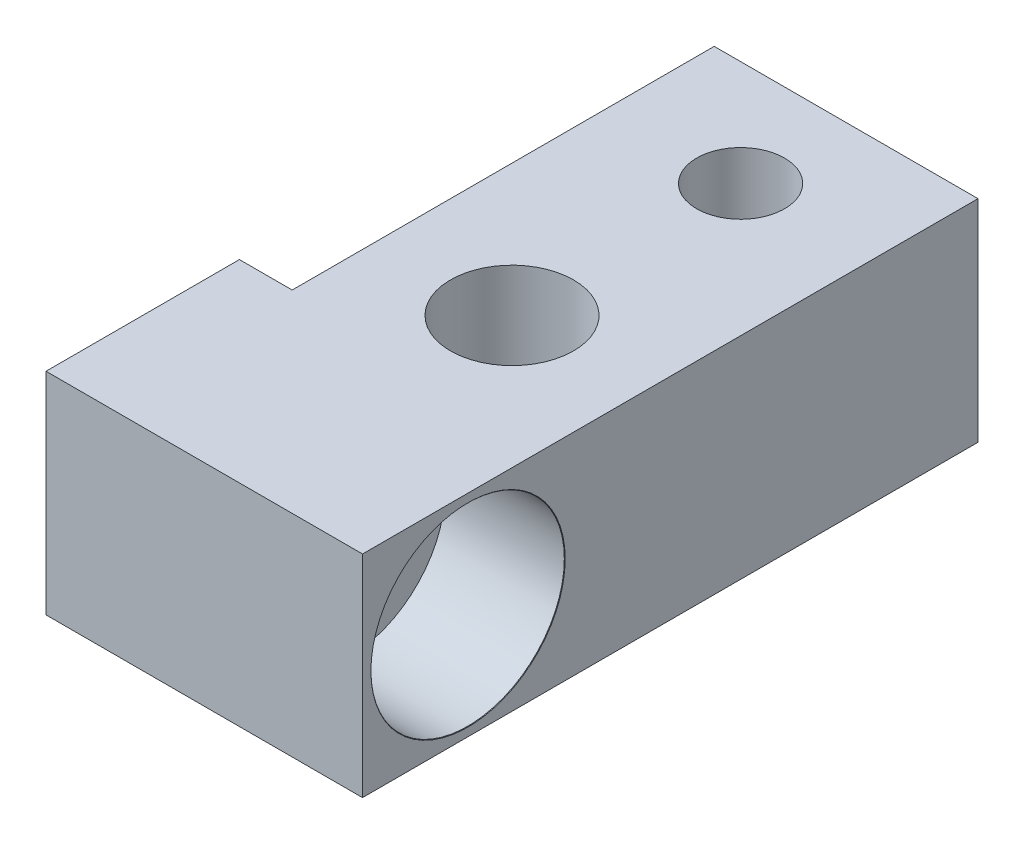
ISO-10303-21;
HEADER;
FILE_DESCRIPTION(('STEP AP214'),'2;1');
FILE_NAME('part.step','',(''),(''),'','','');
FILE_SCHEMA(('AUTOMOTIVE_DESIGN { 1 0 10303 214 1 1 1 1 }'));
ENDSEC;
DATA;
#1=APPLICATION_CONTEXT('core data for automotive mechanical design processes');
#2=APPLICATION_PROTOCOL_DEFINITION('international standard','automotive_design',2000,#1);
#3=PRODUCT_CONTEXT('',#1,'mechanical');
#4=PRODUCT('Part','Part','',(#3));
#5=PRODUCT_RELATED_PRODUCT_CATEGORY('part','',(#4));
#6=PRODUCT_DEFINITION_FORMATION('','',#4);
#7=PRODUCT_DEFINITION_CONTEXT('part definition',#1,'design');
#8=PRODUCT_DEFINITION('design','',#6,#7);
#9=PRODUCT_DEFINITION_SHAPE('','',#8);
#10=(LENGTH_UNIT() NAMED_UNIT(*) SI_UNIT(.MILLI.,.METRE.));
#11=(NAMED_UNIT(*) PLANE_ANGLE_UNIT() SI_UNIT($,.RADIAN.));
#12=(NAMED_UNIT(*) SI_UNIT($,.STERADIAN.) SOLID_ANGLE_UNIT());
#13=UNCERTAINTY_MEASURE_WITH_UNIT(LENGTH_MEASURE(1.E-05),#10,'distance_accuracy_value','');
#14=(GEOMETRIC_REPRESENTATION_CONTEXT(3) GLOBAL_UNCERTAINTY_ASSIGNED_CONTEXT((#13)) GLOBAL_UNIT_ASSIGNED_CONTEXT((#10,
#11,#12)) REPRESENTATION_CONTEXT('',''));
#15=CARTESIAN_POINT('',(0.,0.,0.));
#16=DIRECTION('',(0.,0.,1.));
#17=DIRECTION('',(1.,0.,0.));
#18=AXIS2_PLACEMENT_3D('',#15,#16,#17);
#19=CARTESIAN_POINT('',(33.,67.,-35.));
#20=DIRECTION('',(-1.,0.,0.));
#21=DIRECTION('',(0.,0.,1.));
#22=AXIS2_PLACEMENT_3D('',#19,#20,#21);
#23=PLANE('',#22);
#24=CARTESIAN_POINT('',(33.,61.,-6.));
#25=DIRECTION('',(1.,0.,0.));
#26=DIRECTION('',(0.,0.,-1.));
#27=AXIS2_PLACEMENT_3D('',#24,#25,#26);
#28=CIRCLE('',#27,3.3);
#29=CARTESIAN_POINT('',(33.,61.,-9.3));
#30=VERTEX_POINT('',#29);
#31=EDGE_CURVE('E121',#30,#30,#28,.T.);
#32=ORIENTED_EDGE('',*,*,#31,.T.);
#33=EDGE_LOOP('',(#32));
#34=FACE_BOUND('',#33,.T.);
#35=DIRECTION('',(0.,-1.,0.));
#36=VECTOR('',#35,1.);
#37=CARTESIAN_POINT('',(33.,67.,-11.));
#38=LINE('',#37,#36);
#39=CARTESIAN_POINT('',(33.,67.,-11.));
#40=VERTEX_POINT('',#39);
#41=CARTESIAN_POINT('',(33.,55.,-11.));
#42=VERTEX_POINT('',#41);
#43=EDGE_CURVE('E72',#40,#42,#38,.T.);
#44=ORIENTED_EDGE('',*,*,#43,.T.);
#45=DIRECTION('',(0.,0.,1.));
#46=VECTOR('',#45,1.);
#47=CARTESIAN_POINT('',(33.,55.,-35.));
#48=LINE('',#47,#46);
#49=CARTESIAN_POINT('',(33.,55.,0.));
#50=VERTEX_POINT('',#49);
#51=EDGE_CURVE('E19',#42,#50,#48,.T.);
#52=ORIENTED_EDGE('',*,*,#51,.T.);
#53=DIRECTION('',(0.,-1.,0.));
#54=VECTOR('',#53,1.);
#55=CARTESIAN_POINT('',(33.,67.,0.));
#56=LINE('',#55,#54);
#57=CARTESIAN_POINT('',(33.,67.,0.));
#58=VERTEX_POINT('',#57);
#59=EDGE_CURVE('E66',#58,#50,#56,.T.);
#60=ORIENTED_EDGE('',*,*,#59,.F.);
#61=DIRECTION('',(0.,0.,1.));
#62=VECTOR('',#61,1.);
#63=CARTESIAN_POINT('',(33.,67.,-35.));
#64=LINE('',#63,#62);
#65=EDGE_CURVE('E11',#40,#58,#64,.T.);
#66=ORIENTED_EDGE('',*,*,#65,.F.);
#67=EDGE_LOOP('',(#44,#52,#60,#66));
#68=FACE_BOUND('',#67,.T.);
#69=ADVANCED_FACE('F16',(#34,#68),#23,.T.);
#70=CARTESIAN_POINT('',(33.,67.,-35.));
#71=DIRECTION('',(0.,1.,0.));
#72=DIRECTION('',(0.,0.,1.));
#73=AXIS2_PLACEMENT_3D('',#70,#71,#72);
#74=PLANE('',#73);
#75=CARTESIAN_POINT('',(43.5,67.,-16.));
#76=DIRECTION('',(0.,-1.,0.));
#77=DIRECTION('',(0.,0.,-1.));
#78=AXIS2_PLACEMENT_3D('',#75,#76,#77);
#79=CIRCLE('',#78,3.5);
#80=CARTESIAN_POINT('',(43.5,67.,-19.5));
#81=VERTEX_POINT('',#80);
#82=EDGE_CURVE('E147',#81,#81,#79,.T.);
#83=ORIENTED_EDGE('',*,*,#82,.T.);
#84=EDGE_LOOP('',(#83));
#85=FACE_BOUND('',#84,.T.);
#86=CARTESIAN_POINT('',(43.5,67.,-29.));
#87=DIRECTION('',(0.,-1.,0.));
#88=DIRECTION('',(0.,0.,-1.));
#89=AXIS2_PLACEMENT_3D('',#86,#87,#88);
#90=CIRCLE('',#89,2.5);
#91=CARTESIAN_POINT('',(43.5,67.,-31.5));
#92=VERTEX_POINT('',#91);
#93=EDGE_CURVE('E141',#92,#92,#90,.T.);
#94=ORIENTED_EDGE('',*,*,#93,.T.);
#95=EDGE_LOOP('',(#94));
#96=FACE_BOUND('',#95,.T.);
#97=DIRECTION('',(-1.,0.,0.));
#98=VECTOR('',#97,1.);
#99=CARTESIAN_POINT('',(33.,67.,-11.));
#100=LINE('',#99,#98);
#101=CARTESIAN_POINT('',(36.,67.,-11.));
#102=VERTEX_POINT('',#101);
#103=EDGE_CURVE('E62',#102,#40,#100,.T.);
#104=ORIENTED_EDGE('',*,*,#103,.T.);
#105=ORIENTED_EDGE('',*,*,#65,.T.);
#106=DIRECTION('',(-1.,0.,0.));
#107=VECTOR('',#106,1.);
#108=CARTESIAN_POINT('',(33.,67.,0.));
#109=LINE('',#108,#107);
#110=CARTESIAN_POINT('',(51.,67.,0.));
#111=VERTEX_POINT('',#110);
#112=EDGE_CURVE('E60',#111,#58,#109,.T.);
#113=ORIENTED_EDGE('',*,*,#112,.F.);
#114=DIRECTION('',(0.,0.,1.));
#115=VECTOR('',#114,1.);
#116=CARTESIAN_POINT('',(51.,67.,-35.));
#117=LINE('',#116,#115);
#118=CARTESIAN_POINT('',(51.,67.,-35.));
#119=VERTEX_POINT('',#118);
#120=EDGE_CURVE('E24',#119,#111,#117,.T.);
#121=ORIENTED_EDGE('',*,*,#120,.F.);
#122=DIRECTION('',(-1.,0.,0.));
#123=VECTOR('',#122,1.);
#124=CARTESIAN_POINT('',(33.,67.,-35.));
#125=LINE('',#124,#123);
#126=CARTESIAN_POINT('',(36.,67.,-35.));
#127=VERTEX_POINT('',#126);
#128=EDGE_CURVE('E88',#119,#127,#125,.T.);
#129=ORIENTED_EDGE('',*,*,#128,.T.);
#130=DIRECTION('',(0.,0.,1.));
#131=VECTOR('',#130,1.);
#132=CARTESIAN_POINT('',(36.,67.,-35.));
#133=LINE('',#132,#131);
#134=EDGE_CURVE('E32',#127,#102,#133,.T.);
#135=ORIENTED_EDGE('',*,*,#134,.T.);
#136=EDGE_LOOP('',(#104,#105,#113,#121,#129,#135));
#137=FACE_BOUND('',#136,.T.);
#138=ADVANCED_FACE('F58',(#85,#96,#137),#74,.T.);
#139=CARTESIAN_POINT('',(51.,67.,-35.));
#140=DIRECTION('',(1.,0.,0.));
#141=DIRECTION('',(0.,0.,-1.));
#142=AXIS2_PLACEMENT_3D('',#139,#140,#141);
#143=PLANE('',#142);
#144=CARTESIAN_POINT('',(51.,61.,-6.));
#145=DIRECTION('',(1.,0.,0.));
#146=DIRECTION('',(0.,0.,-1.));
#147=AXIS2_PLACEMENT_3D('',#144,#145,#146);
#148=CIRCLE('',#147,5.525);
#149=CARTESIAN_POINT('',(51.,61.,-11.525));
#150=VERTEX_POINT('',#149);
#151=EDGE_CURVE('E138',#150,#150,#148,.T.);
#152=ORIENTED_EDGE('',*,*,#151,.F.);
#153=EDGE_LOOP('',(#152));
#154=FACE_BOUND('',#153,.T.);
#155=DIRECTION('',(0.,1.,0.));
#156=VECTOR('',#155,1.);
#157=CARTESIAN_POINT('',(51.,67.,0.));
#158=LINE('',#157,#156);
#159=CARTESIAN_POINT('',(51.,55.,0.));
#160=VERTEX_POINT('',#159);
#161=EDGE_CURVE('E77',#160,#111,#158,.T.);
#162=ORIENTED_EDGE('',*,*,#161,.F.);
#163=DIRECTION('',(0.,0.,1.));
#164=VECTOR('',#163,1.);
#165=CARTESIAN_POINT('',(51.,55.,-35.));
#166=LINE('',#165,#164);
#167=CARTESIAN_POINT('',(51.,55.,-35.));
#168=VERTEX_POINT('',#167);
#169=EDGE_CURVE('E85',#168,#160,#166,.T.);
#170=ORIENTED_EDGE('',*,*,#169,.F.);
#171=DIRECTION('',(0.,1.,0.));
#172=VECTOR('',#171,1.);
#173=CARTESIAN_POINT('',(51.,67.,-35.));
#174=LINE('',#173,#172);
#175=EDGE_CURVE('E80',#168,#119,#174,.T.);
#176=ORIENTED_EDGE('',*,*,#175,.T.);
#177=ORIENTED_EDGE('',*,*,#120,.T.);
#178=EDGE_LOOP('',(#162,#170,#176,#177));
#179=FACE_BOUND('',#178,.T.);
#180=ADVANCED_FACE('F159',(#154,#179),#143,.T.);
#181=CARTESIAN_POINT('',(33.,55.,-35.));
#182=DIRECTION('',(0.,-1.,0.));
#183=DIRECTION('',(0.,0.,-1.));
#184=AXIS2_PLACEMENT_3D('',#181,#182,#183);
#185=PLANE('',#184);
#186=CARTESIAN_POINT('',(43.5,55.,-16.));
#187=DIRECTION('',(0.,-1.,0.));
#188=DIRECTION('',(0.,0.,-1.));
#189=AXIS2_PLACEMENT_3D('',#186,#187,#188);
#190=CIRCLE('',#189,3.5);
#191=CARTESIAN_POINT('',(43.5,55.,-19.5));
#192=VERTEX_POINT('',#191);
#193=EDGE_CURVE('E150',#192,#192,#190,.T.);
#194=ORIENTED_EDGE('',*,*,#193,.F.);
#195=EDGE_LOOP('',(#194));
#196=FACE_BOUND('',#195,.T.);
#197=CARTESIAN_POINT('',(43.5,55.,-29.));
#198=DIRECTION('',(0.,-1.,0.));
#199=DIRECTION('',(0.,0.,-1.));
#200=AXIS2_PLACEMENT_3D('',#197,#198,#199);
#201=CIRCLE('',#200,2.5);
#202=CARTESIAN_POINT('',(43.5,55.,-31.5));
#203=VERTEX_POINT('',#202);
#204=EDGE_CURVE('E144',#203,#203,#201,.T.);
#205=ORIENTED_EDGE('',*,*,#204,.F.);
#206=EDGE_LOOP('',(#205));
#207=FACE_BOUND('',#206,.T.);
#208=DIRECTION('',(-1.,0.,0.));
#209=VECTOR('',#208,1.);
#210=CARTESIAN_POINT('',(33.,55.,-11.));
#211=LINE('',#210,#209);
#212=CARTESIAN_POINT('',(36.,55.,-11.));
#213=VERTEX_POINT('',#212);
#214=EDGE_CURVE('E98',#213,#42,#211,.T.);
#215=ORIENTED_EDGE('',*,*,#214,.F.);
#216=DIRECTION('',(0.,0.,1.));
#217=VECTOR('',#216,1.);
#218=CARTESIAN_POINT('',(36.,55.,-35.));
#219=LINE('',#218,#217);
#220=CARTESIAN_POINT('',(36.,55.,-35.));
#221=VERTEX_POINT('',#220);
#222=EDGE_CURVE('E120',#221,#213,#219,.T.);
#223=ORIENTED_EDGE('',*,*,#222,.F.);
#224=DIRECTION('',(1.,0.,0.));
#225=VECTOR('',#224,1.);
#226=CARTESIAN_POINT('',(33.,55.,-35.));
#227=LINE('',#226,#225);
#228=EDGE_CURVE('E78',#221,#168,#227,.T.);
#229=ORIENTED_EDGE('',*,*,#228,.T.);
#230=ORIENTED_EDGE('',*,*,#169,.T.);
#231=DIRECTION('',(1.,0.,0.));
#232=VECTOR('',#231,1.);
#233=CARTESIAN_POINT('',(33.,55.,0.));
#234=LINE('',#233,#232);
#235=EDGE_CURVE('E71',#50,#160,#234,.T.);
#236=ORIENTED_EDGE('',*,*,#235,.F.);
#237=ORIENTED_EDGE('',*,*,#51,.F.);
#238=EDGE_LOOP('',(#215,#223,#229,#230,#236,#237));
#239=FACE_BOUND('',#238,.T.);
#240=ADVANCED_FACE('F93',(#196,#207,#239),#185,.T.);
#241=CARTESIAN_POINT('',(0.,0.,-35.));
#242=DIRECTION('',(0.,0.,1.));
#243=DIRECTION('',(1.,0.,0.));
#244=AXIS2_PLACEMENT_3D('',#241,#242,#243);
#245=PLANE('',#244);
#246=ORIENTED_EDGE('',*,*,#228,.F.);
#247=DIRECTION('',(0.,-1.,0.));
#248=VECTOR('',#247,1.);
#249=CARTESIAN_POINT('',(36.,67.,-35.));
#250=LINE('',#249,#248);
#251=EDGE_CURVE('E111',#127,#221,#250,.T.);
#252=ORIENTED_EDGE('',*,*,#251,.F.);
#253=ORIENTED_EDGE('',*,*,#128,.F.);
#254=ORIENTED_EDGE('',*,*,#175,.F.);
#255=EDGE_LOOP('',(#246,#252,#253,#254));
#256=FACE_BOUND('',#255,.T.);
#257=ADVANCED_FACE('F158',(#256),#245,.F.);
#258=CARTESIAN_POINT('',(0.,0.,0.));
#259=DIRECTION('',(0.,0.,1.));
#260=DIRECTION('',(1.,0.,0.));
#261=AXIS2_PLACEMENT_3D('',#258,#259,#260);
#262=PLANE('',#261);
#263=ORIENTED_EDGE('',*,*,#59,.T.);
#264=ORIENTED_EDGE('',*,*,#235,.T.);
#265=ORIENTED_EDGE('',*,*,#161,.T.);
#266=ORIENTED_EDGE('',*,*,#112,.T.);
#267=EDGE_LOOP('',(#263,#264,#265,#266));
#268=FACE_BOUND('',#267,.T.);
#269=ADVANCED_FACE('F75',(#268),#262,.T.);
#270=CARTESIAN_POINT('',(33.,67.,-11.));
#271=DIRECTION('',(0.,0.,1.));
#272=DIRECTION('',(1.,0.,0.));
#273=AXIS2_PLACEMENT_3D('',#270,#271,#272);
#274=PLANE('',#273);
#275=ORIENTED_EDGE('',*,*,#214,.T.);
#276=ORIENTED_EDGE('',*,*,#43,.F.);
#277=ORIENTED_EDGE('',*,*,#103,.F.);
#278=DIRECTION('',(0.,-1.,0.));
#279=VECTOR('',#278,1.);
#280=CARTESIAN_POINT('',(36.,67.,-11.));
#281=LINE('',#280,#279);
#282=EDGE_CURVE('E109',#102,#213,#281,.T.);
#283=ORIENTED_EDGE('',*,*,#282,.T.);
#284=EDGE_LOOP('',(#275,#276,#277,#283));
#285=FACE_BOUND('',#284,.T.);
#286=ADVANCED_FACE('F108',(#285),#274,.F.);
#287=CARTESIAN_POINT('',(36.,67.,-35.));
#288=DIRECTION('',(1.,0.,0.));
#289=DIRECTION('',(0.,0.,-1.));
#290=AXIS2_PLACEMENT_3D('',#287,#288,#289);
#291=PLANE('',#290);
#292=ORIENTED_EDGE('',*,*,#222,.T.);
#293=ORIENTED_EDGE('',*,*,#282,.F.);
#294=ORIENTED_EDGE('',*,*,#134,.F.);
#295=ORIENTED_EDGE('',*,*,#251,.T.);
#296=EDGE_LOOP('',(#292,#293,#294,#295));
#297=FACE_BOUND('',#296,.T.);
#298=ADVANCED_FACE('F199',(#297),#291,.F.);
#299=CARTESIAN_POINT('',(51.,61.,-6.));
#300=DIRECTION('',(1.,0.,0.));
#301=DIRECTION('',(0.,0.,-1.));
#302=AXIS2_PLACEMENT_3D('',#299,#300,#301);
#303=CYLINDRICAL_SURFACE('',#302,3.3);
#304=ORIENTED_EDGE('',*,*,#31,.F.);
#305=EDGE_LOOP('',(#304));
#306=FACE_BOUND('',#305,.T.);
#307=CARTESIAN_POINT('',(44.175,61.,-6.));
#308=DIRECTION('',(1.,0.,0.));
#309=DIRECTION('',(0.,0.,-1.));
#310=AXIS2_PLACEMENT_3D('',#307,#308,#309);
#311=CIRCLE('',#310,3.3);
#312=CARTESIAN_POINT('',(44.175,61.,-9.3));
#313=VERTEX_POINT('',#312);
#314=EDGE_CURVE('E123',#313,#313,#311,.T.);
#315=ORIENTED_EDGE('',*,*,#314,.T.);
#316=EDGE_LOOP('',(#315));
#317=FACE_BOUND('',#316,.T.);
#318=ADVANCED_FACE('F202',(#306,#317),#303,.F.);
#319=CARTESIAN_POINT('',(44.2,61.,-6.));
#320=DIRECTION('',(1.,0.,0.));
#321=DIRECTION('',(0.,0.,-1.));
#322=AXIS2_PLACEMENT_3D('',#319,#320,#321);
#323=CONICAL_SURFACE('',#322,3.325,0.785398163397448);
#324=ORIENTED_EDGE('',*,*,#314,.F.);
#325=EDGE_LOOP('',(#324));
#326=FACE_BOUND('',#325,.T.);
#327=CARTESIAN_POINT('',(44.2,61.,-6.));
#328=DIRECTION('',(1.,0.,0.));
#329=DIRECTION('',(0.,0.,-1.));
#330=AXIS2_PLACEMENT_3D('',#327,#328,#329);
#331=CIRCLE('',#330,3.325);
#332=CARTESIAN_POINT('',(44.2,61.,-9.325));
#333=VERTEX_POINT('',#332);
#334=EDGE_CURVE('E127',#333,#333,#331,.T.);
#335=ORIENTED_EDGE('',*,*,#334,.T.);
#336=EDGE_LOOP('',(#335));
#337=FACE_BOUND('',#336,.T.);
#338=ADVANCED_FACE('F207',(#326,#337),#323,.F.);
#339=CARTESIAN_POINT('',(44.2,64.325,-6.));
#340=DIRECTION('',(-1.,0.,0.));
#341=DIRECTION('',(0.,0.,1.));
#342=AXIS2_PLACEMENT_3D('',#339,#340,#341);
#343=PLANE('',#342);
#344=ORIENTED_EDGE('',*,*,#334,.F.);
#345=EDGE_LOOP('',(#344));
#346=FACE_BOUND('',#345,.T.);
#347=CARTESIAN_POINT('',(44.2,61.,-6.));
#348=DIRECTION('',(1.,0.,0.));
#349=DIRECTION('',(0.,0.,-1.));
#350=AXIS2_PLACEMENT_3D('',#347,#348,#349);
#351=CIRCLE('',#350,5.5);
#352=CARTESIAN_POINT('',(44.2,61.,-11.5));
#353=VERTEX_POINT('',#352);
#354=EDGE_CURVE('E132',#353,#353,#351,.T.);
#355=ORIENTED_EDGE('',*,*,#354,.T.);
#356=EDGE_LOOP('',(#355));
#357=FACE_BOUND('',#356,.T.);
#358=ADVANCED_FACE('F211',(#346,#357),#343,.F.);
#359=CARTESIAN_POINT('',(51.,61.,-6.));
#360=DIRECTION('',(1.,0.,0.));
#361=DIRECTION('',(0.,0.,-1.));
#362=AXIS2_PLACEMENT_3D('',#359,#360,#361);
#363=CYLINDRICAL_SURFACE('',#362,5.5);
#364=ORIENTED_EDGE('',*,*,#354,.F.);
#365=EDGE_LOOP('',(#364));
#366=FACE_BOUND('',#365,.T.);
#367=CARTESIAN_POINT('',(50.975,61.,-6.));
#368=DIRECTION('',(1.,0.,0.));
#369=DIRECTION('',(0.,0.,-1.));
#370=AXIS2_PLACEMENT_3D('',#367,#368,#369);
#371=CIRCLE('',#370,5.5);
#372=CARTESIAN_POINT('',(50.975,61.,-11.5));
#373=VERTEX_POINT('',#372);
#374=EDGE_CURVE('E135',#373,#373,#371,.T.);
#375=ORIENTED_EDGE('',*,*,#374,.T.);
#376=EDGE_LOOP('',(#375));
#377=FACE_BOUND('',#376,.T.);
#378=ADVANCED_FACE('F175',(#366,#377),#363,.F.);
#379=CARTESIAN_POINT('',(51.,61.,-6.));
#380=DIRECTION('',(1.,0.,0.));
#381=DIRECTION('',(0.,0.,-1.));
#382=AXIS2_PLACEMENT_3D('',#379,#380,#381);
#383=CONICAL_SURFACE('',#382,5.525,0.785398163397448);
#384=ORIENTED_EDGE('',*,*,#374,.F.);
#385=EDGE_LOOP('',(#384));
#386=FACE_BOUND('',#385,.T.);
#387=ORIENTED_EDGE('',*,*,#151,.T.);
#388=EDGE_LOOP('',(#387));
#389=FACE_BOUND('',#388,.T.);
#390=ADVANCED_FACE('F164',(#386,#389),#383,.F.);
#391=CARTESIAN_POINT('',(43.5,55.,-29.));
#392=DIRECTION('',(0.,-1.,0.));
#393=DIRECTION('',(0.,0.,-1.));
#394=AXIS2_PLACEMENT_3D('',#391,#392,#393);
#395=CYLINDRICAL_SURFACE('',#394,2.5);
#396=ORIENTED_EDGE('',*,*,#93,.F.);
#397=EDGE_LOOP('',(#396));
#398=FACE_BOUND('',#397,.T.);
#399=ORIENTED_EDGE('',*,*,#204,.T.);
#400=EDGE_LOOP('',(#399));
#401=FACE_BOUND('',#400,.T.);
#402=ADVANCED_FACE('F162',(#398,#401),#395,.F.);
#403=CARTESIAN_POINT('',(43.5,55.,-16.));
#404=DIRECTION('',(0.,-1.,0.));
#405=DIRECTION('',(0.,0.,-1.));
#406=AXIS2_PLACEMENT_3D('',#403,#404,#405);
#407=CYLINDRICAL_SURFACE('',#406,3.5);
#408=ORIENTED_EDGE('',*,*,#82,.F.);
#409=EDGE_LOOP('',(#408));
#410=FACE_BOUND('',#409,.T.);
#411=ORIENTED_EDGE('',*,*,#193,.T.);
#412=EDGE_LOOP('',(#411));
#413=FACE_BOUND('',#412,.T.);
#414=ADVANCED_FACE('F154',(#410,#413),#407,.F.);
#415=CLOSED_SHELL('',(#69,#138,#180,#240,#257,#269,#286,#298,#318,#338,#358,#378,#390,#402,#414));
#416=MANIFOLD_SOLID_BREP('B1',#415);
#417=ADVANCED_BREP_SHAPE_REPRESENTATION('',(#18,#416),#14);
#418=SHAPE_DEFINITION_REPRESENTATION(#9,#417);
ENDSEC;
END-ISO-10303-21;
